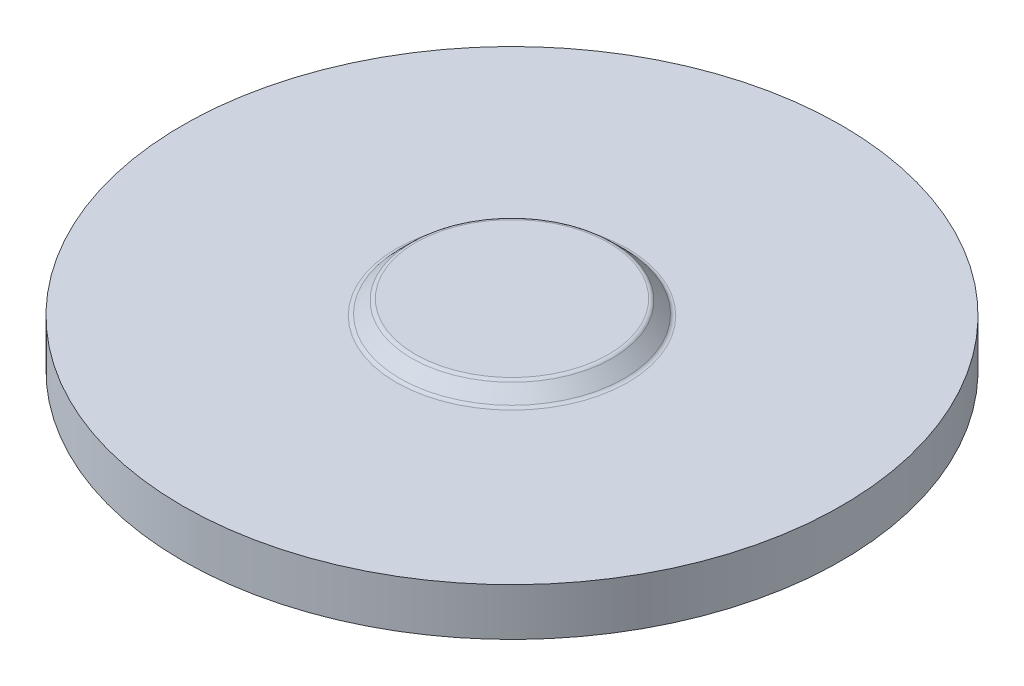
ISO-10303-21;
HEADER;
FILE_DESCRIPTION(('STEP AP214'),'2;1');
FILE_NAME('part.step','',(''),(''),'','','');
FILE_SCHEMA(('AUTOMOTIVE_DESIGN { 1 0 10303 214 1 1 1 1 }'));
ENDSEC;
DATA;
#1=APPLICATION_CONTEXT('core data for automotive mechanical design processes');
#2=APPLICATION_PROTOCOL_DEFINITION('international standard','automotive_design',2000,#1);
#3=PRODUCT_CONTEXT('',#1,'mechanical');
#4=PRODUCT('Part','Part','',(#3));
#5=PRODUCT_RELATED_PRODUCT_CATEGORY('part','',(#4));
#6=PRODUCT_DEFINITION_FORMATION('','',#4);
#7=PRODUCT_DEFINITION_CONTEXT('part definition',#1,'design');
#8=PRODUCT_DEFINITION('design','',#6,#7);
#9=PRODUCT_DEFINITION_SHAPE('','',#8);
#10=(LENGTH_UNIT() NAMED_UNIT(*) SI_UNIT(.MILLI.,.METRE.));
#11=(NAMED_UNIT(*) PLANE_ANGLE_UNIT() SI_UNIT($,.RADIAN.));
#12=(NAMED_UNIT(*) SI_UNIT($,.STERADIAN.) SOLID_ANGLE_UNIT());
#13=UNCERTAINTY_MEASURE_WITH_UNIT(LENGTH_MEASURE(1.E-05),#10,'distance_accuracy_value','');
#14=(GEOMETRIC_REPRESENTATION_CONTEXT(3) GLOBAL_UNCERTAINTY_ASSIGNED_CONTEXT((#13)) GLOBAL_UNIT_ASSIGNED_CONTEXT((#10,
#11,#12)) REPRESENTATION_CONTEXT('',''));
#15=CARTESIAN_POINT('',(0.,0.,0.));
#16=DIRECTION('',(0.,0.,1.));
#17=DIRECTION('',(1.,0.,0.));
#18=AXIS2_PLACEMENT_3D('',#15,#16,#17);
#19=CARTESIAN_POINT('',(0.,0.,0.));
#20=DIRECTION('',(0.,-1.,0.));
#21=DIRECTION('',(0.,0.,-1.));
#22=AXIS2_PLACEMENT_3D('',#19,#20,#21);
#23=PLANE('',#22);
#24=CARTESIAN_POINT('',(0.,0.,0.));
#25=DIRECTION('',(0.,-1.,0.));
#26=DIRECTION('',(0.,0.,1.));
#27=AXIS2_PLACEMENT_3D('',#24,#25,#26);
#28=CIRCLE('',#27,4.65728975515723);
#29=CARTESIAN_POINT('',(0.,0.,4.65728975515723));
#30=VERTEX_POINT('',#29);
#31=CARTESIAN_POINT('',(0.,0.,-4.65728975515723));
#32=VERTEX_POINT('',#31);
#33=EDGE_CURVE('E51',#30,#32,#28,.T.);
#34=ORIENTED_EDGE('',*,*,#33,.F.);
#35=CARTESIAN_POINT('',(0.,0.,0.));
#36=DIRECTION('',(0.,-1.,0.));
#37=DIRECTION('',(0.,0.,-1.));
#38=AXIS2_PLACEMENT_3D('',#35,#36,#37);
#39=CIRCLE('',#38,4.65728975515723);
#40=EDGE_CURVE('E53',#32,#30,#39,.T.);
#41=ORIENTED_EDGE('',*,*,#40,.F.);
#42=EDGE_LOOP('',(#34,#41));
#43=FACE_BOUND('',#42,.T.);
#44=ADVANCED_FACE('F17',(#43),#23,.F.);
#45=CARTESIAN_POINT('',(0.,-2.286,0.));
#46=DIRECTION('',(0.,1.,0.));
#47=DIRECTION('',(0.,0.,1.));
#48=AXIS2_PLACEMENT_3D('',#45,#46,#47);
#49=PLANE('',#48);
#50=CARTESIAN_POINT('',(0.,-2.286,0.));
#51=DIRECTION('',(0.,1.,0.));
#52=DIRECTION('',(0.,0.,1.));
#53=AXIS2_PLACEMENT_3D('',#50,#51,#52);
#54=CIRCLE('',#53,3.81621612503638);
#55=CARTESIAN_POINT('',(0.,-2.286,3.81621612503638));
#56=VERTEX_POINT('',#55);
#57=EDGE_CURVE('E59',#56,#56,#54,.T.);
#58=ORIENTED_EDGE('',*,*,#57,.F.);
#59=EDGE_LOOP('',(#58));
#60=FACE_BOUND('',#59,.T.);
#61=ADVANCED_FACE('F87',(#60),#49,.F.);
#62=CARTESIAN_POINT('',(0.,-0.254,0.));
#63=DIRECTION('',(0.,1.,0.));
#64=DIRECTION('',(0.,0.,1.));
#65=AXIS2_PLACEMENT_3D('',#62,#63,#64);
#66=TOROIDAL_SURFACE('',#65,4.65728975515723,0.254);
#67=ORIENTED_EDGE('',*,*,#33,.T.);
#68=ORIENTED_EDGE('',*,*,#40,.T.);
#69=EDGE_LOOP('',(#67,#68));
#70=FACE_BOUND('',#69,.T.);
#71=CARTESIAN_POINT('',(0.,-0.0743948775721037,0.));
#72=DIRECTION('',(0.,-1.,0.));
#73=DIRECTION('',(0.,0.,-1.));
#74=AXIS2_PLACEMENT_3D('',#71,#72,#73);
#75=CIRCLE('',#74,4.83689487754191);
#76=CARTESIAN_POINT('',(0.,-0.0743948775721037,-4.83689487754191));
#77=VERTEX_POINT('',#76);
#78=EDGE_CURVE('E81',#77,#77,#75,.T.);
#79=ORIENTED_EDGE('',*,*,#78,.F.);
#80=EDGE_LOOP('',(#79));
#81=FACE_BOUND('',#80,.T.);
#82=ADVANCED_FACE('F55',(#70,#81),#66,.T.);
#83=CARTESIAN_POINT('',(0.,-0.4572,0.));
#84=DIRECTION('',(0.,1.,0.));
#85=DIRECTION('',(0.,0.,1.));
#86=AXIS2_PLACEMENT_3D('',#83,#84,#85);
#87=TOROIDAL_SURFACE('',#86,5.57891024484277,2.54);
#88=CARTESIAN_POINT('',(0.,-2.9972,0.));
#89=DIRECTION('',(0.,-1.,0.));
#90=DIRECTION('',(0.,0.,1.));
#91=AXIS2_PLACEMENT_3D('',#88,#89,#90);
#92=CIRCLE('',#91,5.57891024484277);
#93=CARTESIAN_POINT('',(0.,-2.9972,5.57891024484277));
#94=VERTEX_POINT('',#93);
#95=CARTESIAN_POINT('',(0.,-2.9972,-5.57891024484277));
#96=VERTEX_POINT('',#95);
#97=EDGE_CURVE('E148',#94,#96,#92,.T.);
#98=ORIENTED_EDGE('',*,*,#97,.T.);
#99=CARTESIAN_POINT('',(0.,-2.9972,0.));
#100=DIRECTION('',(0.,-1.,0.));
#101=DIRECTION('',(0.,0.,-1.));
#102=AXIS2_PLACEMENT_3D('',#99,#100,#101);
#103=CIRCLE('',#102,5.57891024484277);
#104=EDGE_CURVE('E159',#96,#94,#103,.T.);
#105=ORIENTED_EDGE('',*,*,#104,.T.);
#106=EDGE_LOOP('',(#98,#105));
#107=FACE_BOUND('',#106,.T.);
#108=ORIENTED_EDGE('',*,*,#57,.T.);
#109=EDGE_LOOP('',(#108));
#110=FACE_BOUND('',#109,.T.);
#111=ADVANCED_FACE('F86',(#107,#110),#87,.T.);
#112=CARTESIAN_POINT('',(0.,-0.63680512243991,0.));
#113=DIRECTION('',(0.,-1.,0.));
#114=DIRECTION('',(0.,0.,-1.));
#115=AXIS2_PLACEMENT_3D('',#112,#113,#114);
#116=CONICAL_SURFACE('',#115,5.39930512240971,0.785398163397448);
#117=CARTESIAN_POINT('',(0.,-0.636805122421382,0.));
#118=DIRECTION('',(0.,1.,0.));
#119=DIRECTION('',(0.,0.,1.));
#120=AXIS2_PLACEMENT_3D('',#117,#118,#119);
#121=CIRCLE('',#120,5.39930512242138);
#122=CARTESIAN_POINT('',(0.,-0.636805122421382,5.39930512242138));
#123=VERTEX_POINT('',#122);
#124=EDGE_CURVE('E104',#123,#123,#121,.T.);
#125=ORIENTED_EDGE('',*,*,#124,.T.);
#126=EDGE_LOOP('',(#125));
#127=FACE_BOUND('',#126,.T.);
#128=ORIENTED_EDGE('',*,*,#78,.T.);
#129=EDGE_LOOP('',(#128));
#130=FACE_BOUND('',#129,.T.);
#131=ADVANCED_FACE('F183',(#127,#130),#116,.T.);
#132=CARTESIAN_POINT('',(5.57891024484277,-2.9972,0.));
#133=DIRECTION('',(0.,1.,0.));
#134=DIRECTION('',(0.,0.,1.));
#135=AXIS2_PLACEMENT_3D('',#132,#133,#134);
#136=PLANE('',#135);
#137=ORIENTED_EDGE('',*,*,#97,.F.);
#138=ORIENTED_EDGE('',*,*,#104,.F.);
#139=EDGE_LOOP('',(#137,#138));
#140=FACE_BOUND('',#139,.T.);
#141=CARTESIAN_POINT('',(0.,-2.9972,0.));
#142=DIRECTION('',(0.,1.,0.));
#143=DIRECTION('',(0.,0.,1.));
#144=AXIS2_PLACEMENT_3D('',#141,#142,#143);
#145=CIRCLE('',#144,15.875);
#146=CARTESIAN_POINT('',(0.,-2.9972,15.875));
#147=VERTEX_POINT('',#146);
#148=EDGE_CURVE('E100',#147,#147,#145,.T.);
#149=ORIENTED_EDGE('',*,*,#148,.F.);
#150=EDGE_LOOP('',(#149));
#151=FACE_BOUND('',#150,.T.);
#152=ADVANCED_FACE('F127',(#140,#151),#136,.F.);
#153=CARTESIAN_POINT('',(0.,-0.4572,0.));
#154=DIRECTION('',(0.,1.,0.));
#155=DIRECTION('',(0.,0.,1.));
#156=AXIS2_PLACEMENT_3D('',#153,#154,#155);
#157=TOROIDAL_SURFACE('',#156,5.57891024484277,0.254);
#158=ORIENTED_EDGE('',*,*,#124,.F.);
#159=EDGE_LOOP('',(#158));
#160=FACE_BOUND('',#159,.T.);
#161=CARTESIAN_POINT('',(0.,-0.7112,0.));
#162=DIRECTION('',(0.,1.,0.));
#163=DIRECTION('',(0.,0.,-1.));
#164=AXIS2_PLACEMENT_3D('',#161,#162,#163);
#165=CIRCLE('',#164,5.57891024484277);
#166=CARTESIAN_POINT('',(0.,-0.7112,-5.57891024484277));
#167=VERTEX_POINT('',#166);
#168=CARTESIAN_POINT('',(0.,-0.7112,5.57891024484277));
#169=VERTEX_POINT('',#168);
#170=EDGE_CURVE('E103',#167,#169,#165,.T.);
#171=ORIENTED_EDGE('',*,*,#170,.T.);
#172=CARTESIAN_POINT('',(0.,-0.7112,0.));
#173=DIRECTION('',(0.,1.,0.));
#174=DIRECTION('',(0.,0.,1.));
#175=AXIS2_PLACEMENT_3D('',#172,#173,#174);
#176=CIRCLE('',#175,5.57891024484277);
#177=EDGE_CURVE('E29',#169,#167,#176,.T.);
#178=ORIENTED_EDGE('',*,*,#177,.T.);
#179=EDGE_LOOP('',(#171,#178));
#180=FACE_BOUND('',#179,.T.);
#181=ADVANCED_FACE('F115',(#160,#180),#157,.F.);
#182=CARTESIAN_POINT('',(0.,0.,0.));
#183=DIRECTION('',(0.,1.,0.));
#184=DIRECTION('',(0.,0.,1.));
#185=AXIS2_PLACEMENT_3D('',#182,#183,#184);
#186=CYLINDRICAL_SURFACE('',#185,15.875);
#187=CARTESIAN_POINT('',(0.,-0.7112,0.));
#188=DIRECTION('',(0.,1.,0.));
#189=DIRECTION('',(0.,0.,1.));
#190=AXIS2_PLACEMENT_3D('',#187,#188,#189);
#191=CIRCLE('',#190,15.875);
#192=CARTESIAN_POINT('',(0.,-0.7112,15.875));
#193=VERTEX_POINT('',#192);
#194=EDGE_CURVE('E10',#193,#193,#191,.F.);
#195=ORIENTED_EDGE('',*,*,#194,.T.);
#196=EDGE_LOOP('',(#195));
#197=FACE_BOUND('',#196,.T.);
#198=ORIENTED_EDGE('',*,*,#148,.T.);
#199=EDGE_LOOP('',(#198));
#200=FACE_BOUND('',#199,.T.);
#201=ADVANCED_FACE('F126',(#197,#200),#186,.T.);
#202=CARTESIAN_POINT('',(5.57891024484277,-0.7112,0.));
#203=DIRECTION('',(0.,-1.,0.));
#204=DIRECTION('',(0.,0.,-1.));
#205=AXIS2_PLACEMENT_3D('',#202,#203,#204);
#206=PLANE('',#205);
#207=ORIENTED_EDGE('',*,*,#194,.F.);
#208=EDGE_LOOP('',(#207));
#209=FACE_BOUND('',#208,.T.);
#210=ORIENTED_EDGE('',*,*,#170,.F.);
#211=ORIENTED_EDGE('',*,*,#177,.F.);
#212=EDGE_LOOP('',(#210,#211));
#213=FACE_BOUND('',#212,.T.);
#214=ADVANCED_FACE('F191',(#209,#213),#206,.F.);
#215=CLOSED_SHELL('',(#44,#61,#82,#111,#131,#152,#181,#201,#214));
#216=MANIFOLD_SOLID_BREP('B1',#215);
#217=ADVANCED_BREP_SHAPE_REPRESENTATION('',(#18,#216),#14);
#218=SHAPE_DEFINITION_REPRESENTATION(#9,#217);
ENDSEC;
END-ISO-10303-21;
